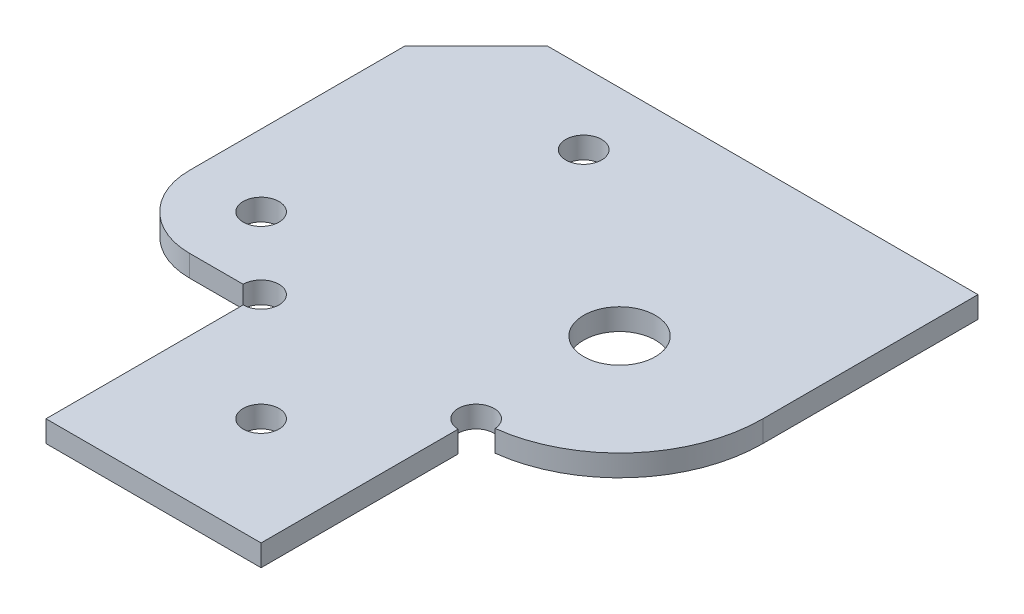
from build123d import *

# Parameters (mm, degrees)
SKETCH1_R      = 2.5
SKETCH1_R_2    = 5
EXTRUDE1_DEPTH = 3


with BuildPart() as part:
    # Sketch1 → Extrude1 (new body)
    with BuildSketch(Plane(origin=(0, 0, 0), x_dir=(1, 0, 0), z_dir=(0, 1, 0))):
        with BuildLine():
            Line((20, 0), (50, 0))
            Line((50, 0), (50, 27.5))
            ThreePointArc((50, 27.5), (48.177827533, 31.711632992), (52.49511241, 30.15625))
            ThreePointArc((52.49511241, 30.15625), (64.998370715, 36.769396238), (70, 50))
            Line((70, 50), (70, 80))
            Line((70, 80), (10, 80))
            Line((10, 80), (0, 70))
            Line((0, 70), (0, 40))
            ThreePointArc((0, 40), (2.928932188, 32.928932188), (10, 30))
            Line((10, 30), (17.5, 30))
            ThreePointArc((17.5, 30), (21.767766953, 31.767766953), (20, 27.5))
            Line((20, 27.5), (20, 0))
        make_face()
        with Locations(Location((35, 15, 0), (0, 0, 270))):
            Circle(SKETCH1_R, mode=Mode.SUBTRACT)
        with Locations(Location((10, 40, 0), (0, 0, 270))):
            Circle(SKETCH1_R, mode=Mode.SUBTRACT)
        with Locations(Location((50, 50, 0), (0, 0, 270))):
            Circle(SKETCH1_R_2, mode=Mode.SUBTRACT)
        with Locations(Location((25, 70, 0), (0, 0, 270))):
            Circle(SKETCH1_R, mode=Mode.SUBTRACT)
    extrude(amount=EXTRUDE1_DEPTH)


solid = part.part
